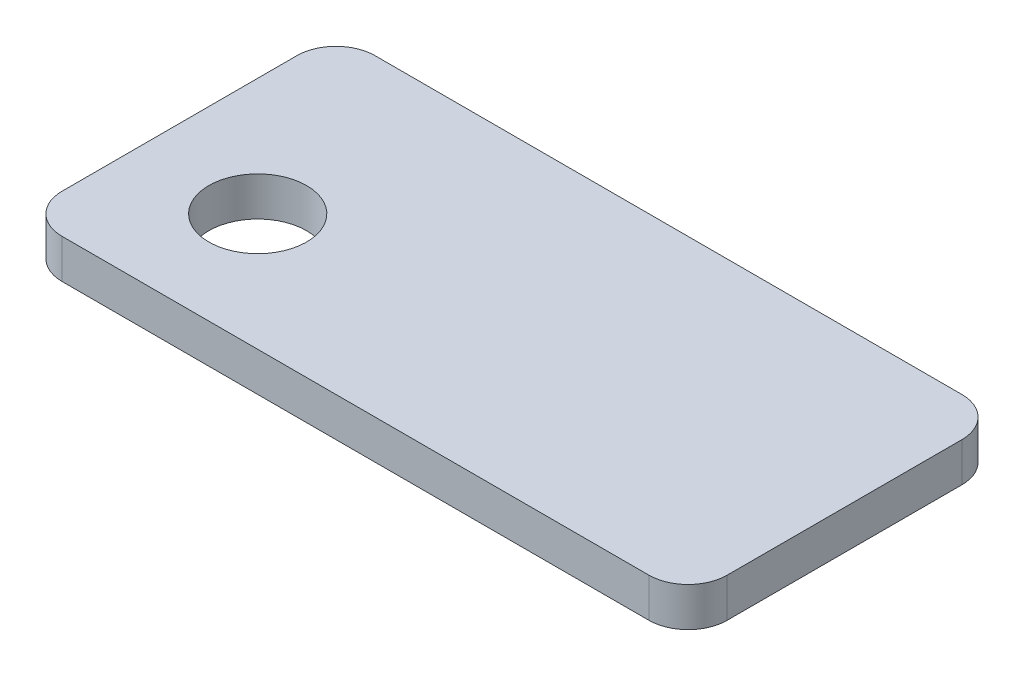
ISO-10303-21;
HEADER;
FILE_DESCRIPTION(('STEP AP214'),'2;1');
FILE_NAME('part.step','',(''),(''),'','','');
FILE_SCHEMA(('AUTOMOTIVE_DESIGN { 1 0 10303 214 1 1 1 1 }'));
ENDSEC;
DATA;
#1=APPLICATION_CONTEXT('core data for automotive mechanical design processes');
#2=APPLICATION_PROTOCOL_DEFINITION('international standard','automotive_design',2000,#1);
#3=PRODUCT_CONTEXT('',#1,'mechanical');
#4=PRODUCT('Part','Part','',(#3));
#5=PRODUCT_RELATED_PRODUCT_CATEGORY('part','',(#4));
#6=PRODUCT_DEFINITION_FORMATION('','',#4);
#7=PRODUCT_DEFINITION_CONTEXT('part definition',#1,'design');
#8=PRODUCT_DEFINITION('design','',#6,#7);
#9=PRODUCT_DEFINITION_SHAPE('','',#8);
#10=(LENGTH_UNIT() NAMED_UNIT(*) SI_UNIT(.MILLI.,.METRE.));
#11=(NAMED_UNIT(*) PLANE_ANGLE_UNIT() SI_UNIT($,.RADIAN.));
#12=(NAMED_UNIT(*) SI_UNIT($,.STERADIAN.) SOLID_ANGLE_UNIT());
#13=UNCERTAINTY_MEASURE_WITH_UNIT(LENGTH_MEASURE(1.E-05),#10,'distance_accuracy_value','');
#14=(GEOMETRIC_REPRESENTATION_CONTEXT(3) GLOBAL_UNCERTAINTY_ASSIGNED_CONTEXT((#13)) GLOBAL_UNIT_ASSIGNED_CONTEXT((#10,
#11,#12)) REPRESENTATION_CONTEXT('',''));
#15=CARTESIAN_POINT('',(0.,0.,0.));
#16=DIRECTION('',(0.,0.,1.));
#17=DIRECTION('',(1.,0.,0.));
#18=AXIS2_PLACEMENT_3D('',#15,#16,#17);
#19=CARTESIAN_POINT('',(-37.5,-2.5,15.));
#20=DIRECTION('',(0.,1.,0.));
#21=DIRECTION('',(0.,0.,1.));
#22=AXIS2_PLACEMENT_3D('',#19,#20,#21);
#23=CYLINDRICAL_SURFACE('',#22,5.);
#24=CARTESIAN_POINT('',(-37.5,2.5,15.));
#25=DIRECTION('',(0.,1.,0.));
#26=DIRECTION('',(0.,0.,1.));
#27=AXIS2_PLACEMENT_3D('',#24,#25,#26);
#28=CIRCLE('',#27,5.);
#29=CARTESIAN_POINT('',(-42.5,2.5,15.));
#30=VERTEX_POINT('',#29);
#31=CARTESIAN_POINT('',(-37.5,2.5,20.));
#32=VERTEX_POINT('',#31);
#33=EDGE_CURVE('E132',#30,#32,#28,.T.);
#34=ORIENTED_EDGE('',*,*,#33,.F.);
#35=DIRECTION('',(0.,1.,0.));
#36=VECTOR('',#35,1.);
#37=CARTESIAN_POINT('',(-42.5,-2.5,15.));
#38=LINE('',#37,#36);
#39=CARTESIAN_POINT('',(-42.5,-2.5,15.));
#40=VERTEX_POINT('',#39);
#41=EDGE_CURVE('E11',#40,#30,#38,.T.);
#42=ORIENTED_EDGE('',*,*,#41,.F.);
#43=CARTESIAN_POINT('',(-37.5,-2.5,15.));
#44=DIRECTION('',(0.,1.,0.));
#45=DIRECTION('',(0.,0.,1.));
#46=AXIS2_PLACEMENT_3D('',#43,#44,#45);
#47=CIRCLE('',#46,5.);
#48=CARTESIAN_POINT('',(-37.5,-2.5,20.));
#49=VERTEX_POINT('',#48);
#50=EDGE_CURVE('E153',#40,#49,#47,.T.);
#51=ORIENTED_EDGE('',*,*,#50,.T.);
#52=DIRECTION('',(0.,1.,0.));
#53=VECTOR('',#52,1.);
#54=CARTESIAN_POINT('',(-37.5,-2.5,20.));
#55=LINE('',#54,#53);
#56=EDGE_CURVE('E38',#49,#32,#55,.T.);
#57=ORIENTED_EDGE('',*,*,#56,.T.);
#58=EDGE_LOOP('',(#34,#42,#51,#57));
#59=FACE_BOUND('',#58,.T.);
#60=ADVANCED_FACE('F35',(#59),#23,.T.);
#61=CARTESIAN_POINT('',(-42.5,-2.5,-15.));
#62=DIRECTION('',(-1.,0.,0.));
#63=DIRECTION('',(0.,0.,1.));
#64=AXIS2_PLACEMENT_3D('',#61,#62,#63);
#65=PLANE('',#64);
#66=DIRECTION('',(0.,0.,1.));
#67=VECTOR('',#66,1.);
#68=CARTESIAN_POINT('',(-42.5,2.5,-15.));
#69=LINE('',#68,#67);
#70=CARTESIAN_POINT('',(-42.5,2.5,-15.));
#71=VERTEX_POINT('',#70);
#72=EDGE_CURVE('E151',#71,#30,#69,.T.);
#73=ORIENTED_EDGE('',*,*,#72,.F.);
#74=DIRECTION('',(0.,1.,0.));
#75=VECTOR('',#74,1.);
#76=CARTESIAN_POINT('',(-42.5,-2.5,-15.));
#77=LINE('',#76,#75);
#78=CARTESIAN_POINT('',(-42.5,-2.5,-15.));
#79=VERTEX_POINT('',#78);
#80=EDGE_CURVE('E44',#79,#71,#77,.T.);
#81=ORIENTED_EDGE('',*,*,#80,.F.);
#82=DIRECTION('',(0.,0.,1.));
#83=VECTOR('',#82,1.);
#84=CARTESIAN_POINT('',(-42.5,-2.5,-15.));
#85=LINE('',#84,#83);
#86=EDGE_CURVE('E122',#79,#40,#85,.T.);
#87=ORIENTED_EDGE('',*,*,#86,.T.);
#88=ORIENTED_EDGE('',*,*,#41,.T.);
#89=EDGE_LOOP('',(#73,#81,#87,#88));
#90=FACE_BOUND('',#89,.T.);
#91=ADVANCED_FACE('F165',(#90),#65,.T.);
#92=CARTESIAN_POINT('',(-37.5,-2.5,-15.));
#93=DIRECTION('',(0.,1.,0.));
#94=DIRECTION('',(0.,0.,1.));
#95=AXIS2_PLACEMENT_3D('',#92,#93,#94);
#96=CYLINDRICAL_SURFACE('',#95,5.);
#97=CARTESIAN_POINT('',(-37.5,2.5,-15.));
#98=DIRECTION('',(0.,1.,0.));
#99=DIRECTION('',(0.,0.,1.));
#100=AXIS2_PLACEMENT_3D('',#97,#98,#99);
#101=CIRCLE('',#100,5.);
#102=CARTESIAN_POINT('',(-37.5,2.5,-20.));
#103=VERTEX_POINT('',#102);
#104=EDGE_CURVE('E109',#103,#71,#101,.T.);
#105=ORIENTED_EDGE('',*,*,#104,.F.);
#106=DIRECTION('',(0.,1.,0.));
#107=VECTOR('',#106,1.);
#108=CARTESIAN_POINT('',(-37.5,-2.5,-20.));
#109=LINE('',#108,#107);
#110=CARTESIAN_POINT('',(-37.5,-2.5,-20.));
#111=VERTEX_POINT('',#110);
#112=EDGE_CURVE('E104',#111,#103,#109,.T.);
#113=ORIENTED_EDGE('',*,*,#112,.F.);
#114=CARTESIAN_POINT('',(-37.5,-2.5,-15.));
#115=DIRECTION('',(0.,1.,0.));
#116=DIRECTION('',(0.,0.,1.));
#117=AXIS2_PLACEMENT_3D('',#114,#115,#116);
#118=CIRCLE('',#117,5.);
#119=EDGE_CURVE('E107',#111,#79,#118,.T.);
#120=ORIENTED_EDGE('',*,*,#119,.T.);
#121=ORIENTED_EDGE('',*,*,#80,.T.);
#122=EDGE_LOOP('',(#105,#113,#120,#121));
#123=FACE_BOUND('',#122,.T.);
#124=ADVANCED_FACE('F106',(#123),#96,.T.);
#125=CARTESIAN_POINT('',(37.5,-2.5,-20.));
#126=DIRECTION('',(0.,0.,-1.));
#127=DIRECTION('',(-1.,0.,0.));
#128=AXIS2_PLACEMENT_3D('',#125,#126,#127);
#129=PLANE('',#128);
#130=DIRECTION('',(-1.,0.,0.));
#131=VECTOR('',#130,1.);
#132=CARTESIAN_POINT('',(37.5,2.5,-20.));
#133=LINE('',#132,#131);
#134=CARTESIAN_POINT('',(37.5,2.5,-20.));
#135=VERTEX_POINT('',#134);
#136=EDGE_CURVE('E148',#135,#103,#133,.T.);
#137=ORIENTED_EDGE('',*,*,#136,.F.);
#138=DIRECTION('',(0.,1.,0.));
#139=VECTOR('',#138,1.);
#140=CARTESIAN_POINT('',(37.5,-2.5,-20.));
#141=LINE('',#140,#139);
#142=CARTESIAN_POINT('',(37.5,-2.5,-20.));
#143=VERTEX_POINT('',#142);
#144=EDGE_CURVE('E114',#143,#135,#141,.T.);
#145=ORIENTED_EDGE('',*,*,#144,.F.);
#146=DIRECTION('',(-1.,0.,0.));
#147=VECTOR('',#146,1.);
#148=CARTESIAN_POINT('',(37.5,-2.5,-20.));
#149=LINE('',#148,#147);
#150=EDGE_CURVE('E120',#143,#111,#149,.T.);
#151=ORIENTED_EDGE('',*,*,#150,.T.);
#152=ORIENTED_EDGE('',*,*,#112,.T.);
#153=EDGE_LOOP('',(#137,#145,#151,#152));
#154=FACE_BOUND('',#153,.T.);
#155=ADVANCED_FACE('F124',(#154),#129,.T.);
#156=CARTESIAN_POINT('',(37.5,-2.5,-15.));
#157=DIRECTION('',(0.,1.,0.));
#158=DIRECTION('',(0.,0.,1.));
#159=AXIS2_PLACEMENT_3D('',#156,#157,#158);
#160=CYLINDRICAL_SURFACE('',#159,5.);
#161=CARTESIAN_POINT('',(37.5,2.5,-15.));
#162=DIRECTION('',(0.,1.,0.));
#163=DIRECTION('',(0.,0.,1.));
#164=AXIS2_PLACEMENT_3D('',#161,#162,#163);
#165=CIRCLE('',#164,5.);
#166=CARTESIAN_POINT('',(42.5,2.5,-15.));
#167=VERTEX_POINT('',#166);
#168=EDGE_CURVE('E145',#167,#135,#165,.T.);
#169=ORIENTED_EDGE('',*,*,#168,.F.);
#170=DIRECTION('',(0.,1.,0.));
#171=VECTOR('',#170,1.);
#172=CARTESIAN_POINT('',(42.5,-2.5,-15.));
#173=LINE('',#172,#171);
#174=CARTESIAN_POINT('',(42.5,-2.5,-15.));
#175=VERTEX_POINT('',#174);
#176=EDGE_CURVE('E157',#175,#167,#173,.T.);
#177=ORIENTED_EDGE('',*,*,#176,.F.);
#178=CARTESIAN_POINT('',(37.5,-2.5,-15.));
#179=DIRECTION('',(0.,1.,0.));
#180=DIRECTION('',(0.,0.,1.));
#181=AXIS2_PLACEMENT_3D('',#178,#179,#180);
#182=CIRCLE('',#181,5.);
#183=EDGE_CURVE('E125',#175,#143,#182,.T.);
#184=ORIENTED_EDGE('',*,*,#183,.T.);
#185=ORIENTED_EDGE('',*,*,#144,.T.);
#186=EDGE_LOOP('',(#169,#177,#184,#185));
#187=FACE_BOUND('',#186,.T.);
#188=ADVANCED_FACE('F178',(#187),#160,.T.);
#189=CARTESIAN_POINT('',(42.5,-2.5,15.));
#190=DIRECTION('',(1.,0.,0.));
#191=DIRECTION('',(0.,0.,-1.));
#192=AXIS2_PLACEMENT_3D('',#189,#190,#191);
#193=PLANE('',#192);
#194=DIRECTION('',(0.,0.,-1.));
#195=VECTOR('',#194,1.);
#196=CARTESIAN_POINT('',(42.5,2.5,15.));
#197=LINE('',#196,#195);
#198=CARTESIAN_POINT('',(42.5,2.5,15.));
#199=VERTEX_POINT('',#198);
#200=EDGE_CURVE('E142',#199,#167,#197,.T.);
#201=ORIENTED_EDGE('',*,*,#200,.F.);
#202=DIRECTION('',(0.,1.,0.));
#203=VECTOR('',#202,1.);
#204=CARTESIAN_POINT('',(42.5,-2.5,15.));
#205=LINE('',#204,#203);
#206=CARTESIAN_POINT('',(42.5,-2.5,15.));
#207=VERTEX_POINT('',#206);
#208=EDGE_CURVE('E159',#207,#199,#205,.T.);
#209=ORIENTED_EDGE('',*,*,#208,.F.);
#210=DIRECTION('',(0.,0.,-1.));
#211=VECTOR('',#210,1.);
#212=CARTESIAN_POINT('',(42.5,-2.5,15.));
#213=LINE('',#212,#211);
#214=EDGE_CURVE('E127',#207,#175,#213,.T.);
#215=ORIENTED_EDGE('',*,*,#214,.T.);
#216=ORIENTED_EDGE('',*,*,#176,.T.);
#217=EDGE_LOOP('',(#201,#209,#215,#216));
#218=FACE_BOUND('',#217,.T.);
#219=ADVANCED_FACE('F181',(#218),#193,.T.);
#220=CARTESIAN_POINT('',(37.5,-2.5,15.));
#221=DIRECTION('',(0.,1.,0.));
#222=DIRECTION('',(0.,0.,1.));
#223=AXIS2_PLACEMENT_3D('',#220,#221,#222);
#224=CYLINDRICAL_SURFACE('',#223,5.);
#225=CARTESIAN_POINT('',(37.5,2.5,15.));
#226=DIRECTION('',(0.,1.,0.));
#227=DIRECTION('',(0.,0.,1.));
#228=AXIS2_PLACEMENT_3D('',#225,#226,#227);
#229=CIRCLE('',#228,5.);
#230=CARTESIAN_POINT('',(37.5,2.5,20.));
#231=VERTEX_POINT('',#230);
#232=EDGE_CURVE('E139',#231,#199,#229,.T.);
#233=ORIENTED_EDGE('',*,*,#232,.F.);
#234=DIRECTION('',(0.,1.,0.));
#235=VECTOR('',#234,1.);
#236=CARTESIAN_POINT('',(37.5,-2.5,20.));
#237=LINE('',#236,#235);
#238=CARTESIAN_POINT('',(37.5,-2.5,20.));
#239=VERTEX_POINT('',#238);
#240=EDGE_CURVE('E160',#239,#231,#237,.T.);
#241=ORIENTED_EDGE('',*,*,#240,.F.);
#242=CARTESIAN_POINT('',(37.5,-2.5,15.));
#243=DIRECTION('',(0.,1.,0.));
#244=DIRECTION('',(0.,0.,1.));
#245=AXIS2_PLACEMENT_3D('',#242,#243,#244);
#246=CIRCLE('',#245,5.);
#247=EDGE_CURVE('E216',#239,#207,#246,.T.);
#248=ORIENTED_EDGE('',*,*,#247,.T.);
#249=ORIENTED_EDGE('',*,*,#208,.T.);
#250=EDGE_LOOP('',(#233,#241,#248,#249));
#251=FACE_BOUND('',#250,.T.);
#252=ADVANCED_FACE('F185',(#251),#224,.T.);
#253=CARTESIAN_POINT('',(-37.5,-2.5,20.));
#254=DIRECTION('',(0.,0.,1.));
#255=DIRECTION('',(1.,0.,0.));
#256=AXIS2_PLACEMENT_3D('',#253,#254,#255);
#257=PLANE('',#256);
#258=DIRECTION('',(1.,0.,0.));
#259=VECTOR('',#258,1.);
#260=CARTESIAN_POINT('',(-37.5,2.5,20.));
#261=LINE('',#260,#259);
#262=EDGE_CURVE('E135',#32,#231,#261,.T.);
#263=ORIENTED_EDGE('',*,*,#262,.F.);
#264=ORIENTED_EDGE('',*,*,#56,.F.);
#265=DIRECTION('',(1.,0.,0.));
#266=VECTOR('',#265,1.);
#267=CARTESIAN_POINT('',(-37.5,-2.5,20.));
#268=LINE('',#267,#266);
#269=EDGE_CURVE('E214',#49,#239,#268,.T.);
#270=ORIENTED_EDGE('',*,*,#269,.T.);
#271=ORIENTED_EDGE('',*,*,#240,.T.);
#272=EDGE_LOOP('',(#263,#264,#270,#271));
#273=FACE_BOUND('',#272,.T.);
#274=ADVANCED_FACE('F162',(#273),#257,.T.);
#275=CARTESIAN_POINT('',(-37.5,-2.5,15.));
#276=DIRECTION('',(0.,1.,0.));
#277=DIRECTION('',(0.,0.,1.));
#278=AXIS2_PLACEMENT_3D('',#275,#276,#277);
#279=PLANE('',#278);
#280=CARTESIAN_POINT('',(-27.5,-2.5,5.));
#281=DIRECTION('',(0.,1.,0.));
#282=DIRECTION('',(0.,0.,-1.));
#283=AXIS2_PLACEMENT_3D('',#280,#281,#282);
#284=CIRCLE('',#283,6.25);
#285=CARTESIAN_POINT('',(-27.5,-2.5,-1.25));
#286=VERTEX_POINT('',#285);
#287=EDGE_CURVE('E136',#286,#286,#284,.T.);
#288=ORIENTED_EDGE('',*,*,#287,.T.);
#289=EDGE_LOOP('',(#288));
#290=FACE_BOUND('',#289,.T.);
#291=ORIENTED_EDGE('',*,*,#50,.F.);
#292=ORIENTED_EDGE('',*,*,#86,.F.);
#293=ORIENTED_EDGE('',*,*,#119,.F.);
#294=ORIENTED_EDGE('',*,*,#150,.F.);
#295=ORIENTED_EDGE('',*,*,#183,.F.);
#296=ORIENTED_EDGE('',*,*,#214,.F.);
#297=ORIENTED_EDGE('',*,*,#247,.F.);
#298=ORIENTED_EDGE('',*,*,#269,.F.);
#299=EDGE_LOOP('',(#291,#292,#293,#294,#295,#296,#297,#298));
#300=FACE_BOUND('',#299,.T.);
#301=ADVANCED_FACE('F118',(#290,#300),#279,.F.);
#302=CARTESIAN_POINT('',(-37.5,2.5,15.));
#303=DIRECTION('',(0.,1.,0.));
#304=DIRECTION('',(0.,0.,1.));
#305=AXIS2_PLACEMENT_3D('',#302,#303,#304);
#306=PLANE('',#305);
#307=CARTESIAN_POINT('',(-27.5,2.5,5.));
#308=DIRECTION('',(0.,1.,0.));
#309=DIRECTION('',(0.,0.,-1.));
#310=AXIS2_PLACEMENT_3D('',#307,#308,#309);
#311=CIRCLE('',#310,6.25);
#312=CARTESIAN_POINT('',(-27.5,2.5,-1.25));
#313=VERTEX_POINT('',#312);
#314=EDGE_CURVE('E209',#313,#313,#311,.T.);
#315=ORIENTED_EDGE('',*,*,#314,.F.);
#316=EDGE_LOOP('',(#315));
#317=FACE_BOUND('',#316,.T.);
#318=ORIENTED_EDGE('',*,*,#33,.T.);
#319=ORIENTED_EDGE('',*,*,#262,.T.);
#320=ORIENTED_EDGE('',*,*,#232,.T.);
#321=ORIENTED_EDGE('',*,*,#200,.T.);
#322=ORIENTED_EDGE('',*,*,#168,.T.);
#323=ORIENTED_EDGE('',*,*,#136,.T.);
#324=ORIENTED_EDGE('',*,*,#104,.T.);
#325=ORIENTED_EDGE('',*,*,#72,.T.);
#326=EDGE_LOOP('',(#318,#319,#320,#321,#322,#323,#324,#325));
#327=FACE_BOUND('',#326,.T.);
#328=ADVANCED_FACE('F164',(#317,#327),#306,.T.);
#329=CARTESIAN_POINT('',(-27.5,-2.5,5.));
#330=DIRECTION('',(0.,1.,0.));
#331=DIRECTION('',(0.,0.,1.));
#332=AXIS2_PLACEMENT_3D('',#329,#330,#331);
#333=CYLINDRICAL_SURFACE('',#332,6.25);
#334=ORIENTED_EDGE('',*,*,#287,.F.);
#335=EDGE_LOOP('',(#334));
#336=FACE_BOUND('',#335,.T.);
#337=ORIENTED_EDGE('',*,*,#314,.T.);
#338=EDGE_LOOP('',(#337));
#339=FACE_BOUND('',#338,.T.);
#340=ADVANCED_FACE('F197',(#336,#339),#333,.F.);
#341=CLOSED_SHELL('',(#60,#91,#124,#155,#188,#219,#252,#274,#301,#328,#340));
#342=MANIFOLD_SOLID_BREP('B2',#341);
#343=ADVANCED_BREP_SHAPE_REPRESENTATION('',(#18,#342),#14);
#344=SHAPE_DEFINITION_REPRESENTATION(#9,#343);
ENDSEC;
END-ISO-10303-21;
